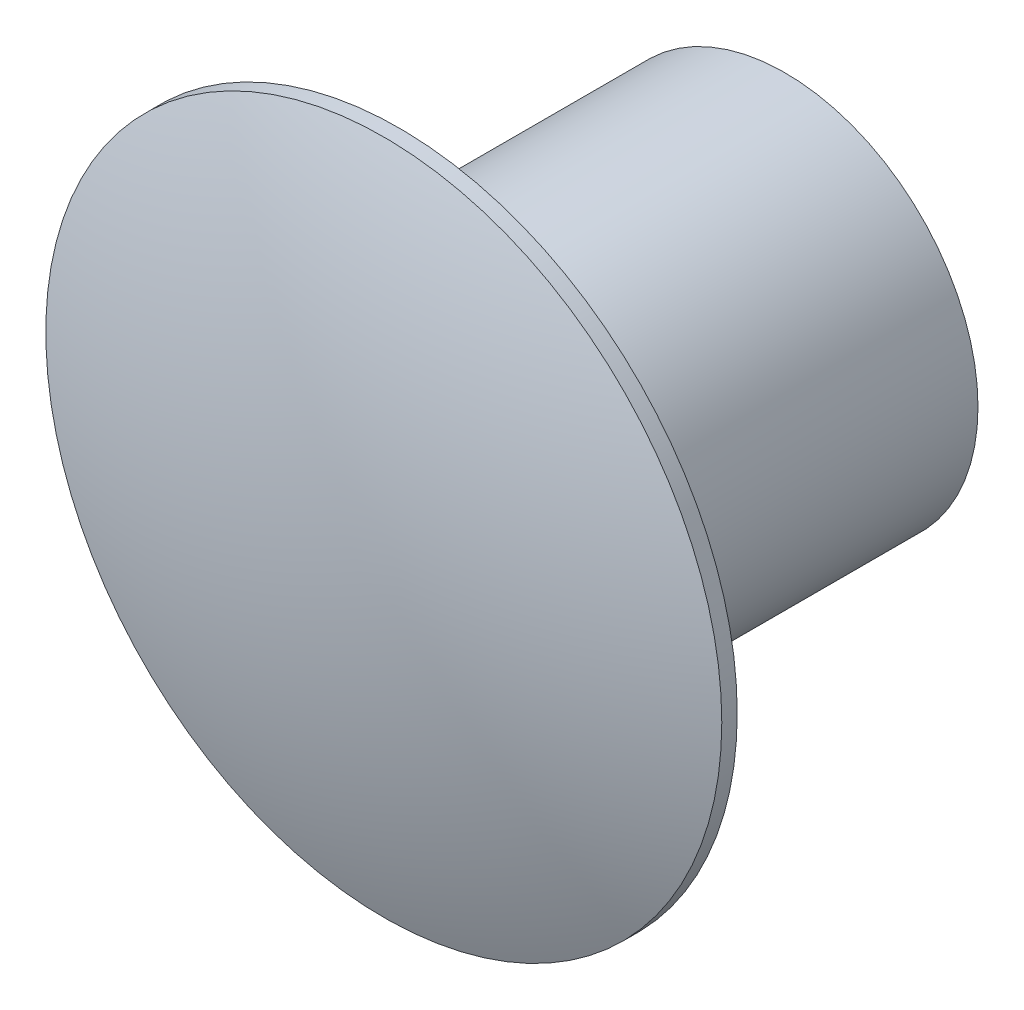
ISO-10303-21;
HEADER;
FILE_DESCRIPTION(('STEP AP214'),'2;1');
FILE_NAME('part.step','',(''),(''),'','','');
FILE_SCHEMA(('AUTOMOTIVE_DESIGN { 1 0 10303 214 1 1 1 1 }'));
ENDSEC;
DATA;
#1=APPLICATION_CONTEXT('core data for automotive mechanical design processes');
#2=APPLICATION_PROTOCOL_DEFINITION('international standard','automotive_design',2000,#1);
#3=PRODUCT_CONTEXT('',#1,'mechanical');
#4=PRODUCT('Part','Part','',(#3));
#5=PRODUCT_RELATED_PRODUCT_CATEGORY('part','',(#4));
#6=PRODUCT_DEFINITION_FORMATION('','',#4);
#7=PRODUCT_DEFINITION_CONTEXT('part definition',#1,'design');
#8=PRODUCT_DEFINITION('design','',#6,#7);
#9=PRODUCT_DEFINITION_SHAPE('','',#8);
#10=(LENGTH_UNIT() NAMED_UNIT(*) SI_UNIT(.MILLI.,.METRE.));
#11=(NAMED_UNIT(*) PLANE_ANGLE_UNIT() SI_UNIT($,.RADIAN.));
#12=(NAMED_UNIT(*) SI_UNIT($,.STERADIAN.) SOLID_ANGLE_UNIT());
#13=UNCERTAINTY_MEASURE_WITH_UNIT(LENGTH_MEASURE(1.E-05),#10,'distance_accuracy_value','');
#14=(GEOMETRIC_REPRESENTATION_CONTEXT(3) GLOBAL_UNCERTAINTY_ASSIGNED_CONTEXT((#13)) GLOBAL_UNIT_ASSIGNED_CONTEXT((#10,
#11,#12)) REPRESENTATION_CONTEXT('',''));
#15=CARTESIAN_POINT('',(0.,0.,0.));
#16=DIRECTION('',(0.,0.,1.));
#17=DIRECTION('',(1.,0.,0.));
#18=AXIS2_PLACEMENT_3D('',#15,#16,#17);
#19=CARTESIAN_POINT('',(0.,0.,-3.175));
#20=DIRECTION('',(0.,0.,1.));
#21=DIRECTION('',(1.,0.,0.));
#22=AXIS2_PLACEMENT_3D('',#19,#20,#21);
#23=CYLINDRICAL_SURFACE('',#22,1.5875);
#24=CARTESIAN_POINT('',(0.,0.,-3.175));
#25=DIRECTION('',(0.,0.,1.));
#26=DIRECTION('',(1.,0.,0.));
#27=AXIS2_PLACEMENT_3D('',#24,#25,#26);
#28=CIRCLE('',#27,1.5875);
#29=CARTESIAN_POINT('',(1.5875,0.,-3.175));
#30=VERTEX_POINT('',#29);
#31=EDGE_CURVE('E10',#30,#30,#28,.T.);
#32=ORIENTED_EDGE('',*,*,#31,.T.);
#33=EDGE_LOOP('',(#32));
#34=FACE_BOUND('',#33,.T.);
#35=CARTESIAN_POINT('',(0.,0.,0.));
#36=DIRECTION('',(0.,0.,1.));
#37=DIRECTION('',(1.,0.,0.));
#38=AXIS2_PLACEMENT_3D('',#35,#36,#37);
#39=CIRCLE('',#38,1.5875);
#40=CARTESIAN_POINT('',(1.5875,0.,0.));
#41=VERTEX_POINT('',#40);
#42=EDGE_CURVE('E41',#41,#41,#39,.T.);
#43=ORIENTED_EDGE('',*,*,#42,.F.);
#44=EDGE_LOOP('',(#43));
#45=FACE_BOUND('',#44,.T.);
#46=ADVANCED_FACE('F33',(#34,#45),#23,.T.);
#47=CARTESIAN_POINT('',(0.,0.,-3.175));
#48=DIRECTION('',(0.,0.,1.));
#49=DIRECTION('',(1.,0.,0.));
#50=AXIS2_PLACEMENT_3D('',#47,#48,#49);
#51=PLANE('',#50);
#52=CARTESIAN_POINT('',(0.,0.,-3.175));
#53=DIRECTION('',(0.,0.,-1.));
#54=DIRECTION('',(-1.,0.,0.));
#55=AXIS2_PLACEMENT_3D('',#52,#53,#54);
#56=CIRCLE('',#55,1.20153057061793);
#57=CARTESIAN_POINT('',(-1.20153057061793,0.,-3.175));
#58=VERTEX_POINT('',#57);
#59=EDGE_CURVE('E51',#58,#58,#56,.T.);
#60=ORIENTED_EDGE('',*,*,#59,.F.);
#61=EDGE_LOOP('',(#60));
#62=FACE_BOUND('',#61,.T.);
#63=ORIENTED_EDGE('',*,*,#31,.F.);
#64=EDGE_LOOP('',(#63));
#65=FACE_BOUND('',#64,.T.);
#66=ADVANCED_FACE('F66',(#62,#65),#51,.F.);
#67=CARTESIAN_POINT('',(0.,0.,0.127));
#68=DIRECTION('',(0.,0.,-1.));
#69=DIRECTION('',(-1.,0.,0.));
#70=AXIS2_PLACEMENT_3D('',#67,#68,#69);
#71=CYLINDRICAL_SURFACE('',#70,2.7813);
#72=CARTESIAN_POINT('',(0.,0.,0.127));
#73=DIRECTION('',(0.,0.,1.));
#74=DIRECTION('',(1.,0.,0.));
#75=AXIS2_PLACEMENT_3D('',#72,#73,#74);
#76=CIRCLE('',#75,2.7813);
#77=CARTESIAN_POINT('',(2.7813,0.,0.127));
#78=VERTEX_POINT('',#77);
#79=EDGE_CURVE('E37',#78,#78,#76,.T.);
#80=ORIENTED_EDGE('',*,*,#79,.F.);
#81=EDGE_LOOP('',(#80));
#82=FACE_BOUND('',#81,.T.);
#83=CARTESIAN_POINT('',(0.,0.,0.));
#84=DIRECTION('',(0.,0.,1.));
#85=DIRECTION('',(1.,0.,0.));
#86=AXIS2_PLACEMENT_3D('',#83,#84,#85);
#87=CIRCLE('',#86,2.7813);
#88=CARTESIAN_POINT('',(2.7813,0.,0.));
#89=VERTEX_POINT('',#88);
#90=EDGE_CURVE('E47',#89,#89,#87,.T.);
#91=ORIENTED_EDGE('',*,*,#90,.T.);
#92=EDGE_LOOP('',(#91));
#93=FACE_BOUND('',#92,.T.);
#94=ADVANCED_FACE('F69',(#82,#93),#71,.T.);
#95=CARTESIAN_POINT('',(0.,0.,-7.23280875));
#96=DIRECTION('',(0.,0.,1.));
#97=DIRECTION('',(1.,0.,0.));
#98=AXIS2_PLACEMENT_3D('',#95,#96,#97);
#99=SPHERICAL_SURFACE('',#98,7.86780875);
#100=ORIENTED_EDGE('',*,*,#79,.T.);
#101=EDGE_LOOP('',(#100));
#102=FACE_BOUND('',#101,.T.);
#103=ADVANCED_FACE('F35',(#102),#99,.T.);
#104=CARTESIAN_POINT('',(0.,0.,0.));
#105=DIRECTION('',(0.,0.,1.));
#106=DIRECTION('',(1.,0.,0.));
#107=AXIS2_PLACEMENT_3D('',#104,#105,#106);
#108=PLANE('',#107);
#109=ORIENTED_EDGE('',*,*,#42,.T.);
#110=EDGE_LOOP('',(#109));
#111=FACE_BOUND('',#110,.T.);
#112=ORIENTED_EDGE('',*,*,#90,.F.);
#113=EDGE_LOOP('',(#112));
#114=FACE_BOUND('',#113,.T.);
#115=ADVANCED_FACE('F62',(#111,#114),#108,.F.);
#116=CARTESIAN_POINT('',(0.,0.,-2.667));
#117=DIRECTION('',(0.,0.,-1.));
#118=DIRECTION('',(-1.,0.,0.));
#119=AXIS2_PLACEMENT_3D('',#116,#117,#118);
#120=CYLINDRICAL_SURFACE('',#119,1.20153057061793);
#121=CARTESIAN_POINT('',(0.,0.,-2.667));
#122=DIRECTION('',(0.,0.,-1.));
#123=DIRECTION('',(-1.,0.,0.));
#124=AXIS2_PLACEMENT_3D('',#121,#122,#123);
#125=CIRCLE('',#124,1.20153057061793);
#126=CARTESIAN_POINT('',(-1.20153057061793,0.,-2.667));
#127=VERTEX_POINT('',#126);
#128=EDGE_CURVE('E50',#127,#127,#125,.T.);
#129=ORIENTED_EDGE('',*,*,#128,.F.);
#130=EDGE_LOOP('',(#129));
#131=FACE_BOUND('',#130,.T.);
#132=ORIENTED_EDGE('',*,*,#59,.T.);
#133=EDGE_LOOP('',(#132));
#134=FACE_BOUND('',#133,.T.);
#135=ADVANCED_FACE('F59',(#131,#134),#120,.F.);
#136=CARTESIAN_POINT('',(0.,0.,-2.667));
#137=DIRECTION('',(0.,0.,-1.));
#138=DIRECTION('',(-1.,0.,0.));
#139=AXIS2_PLACEMENT_3D('',#136,#137,#138);
#140=PLANE('',#139);
#141=ORIENTED_EDGE('',*,*,#128,.T.);
#142=EDGE_LOOP('',(#141));
#143=FACE_BOUND('',#142,.T.);
#144=ADVANCED_FACE('F57',(#143),#140,.T.);
#145=CLOSED_SHELL('',(#46,#66,#94,#103,#115,#135,#144));
#146=MANIFOLD_SOLID_BREP('B2',#145);
#147=ADVANCED_BREP_SHAPE_REPRESENTATION('',(#18,#146),#14);
#148=SHAPE_DEFINITION_REPRESENTATION(#9,#147);
ENDSEC;
END-ISO-10303-21;
